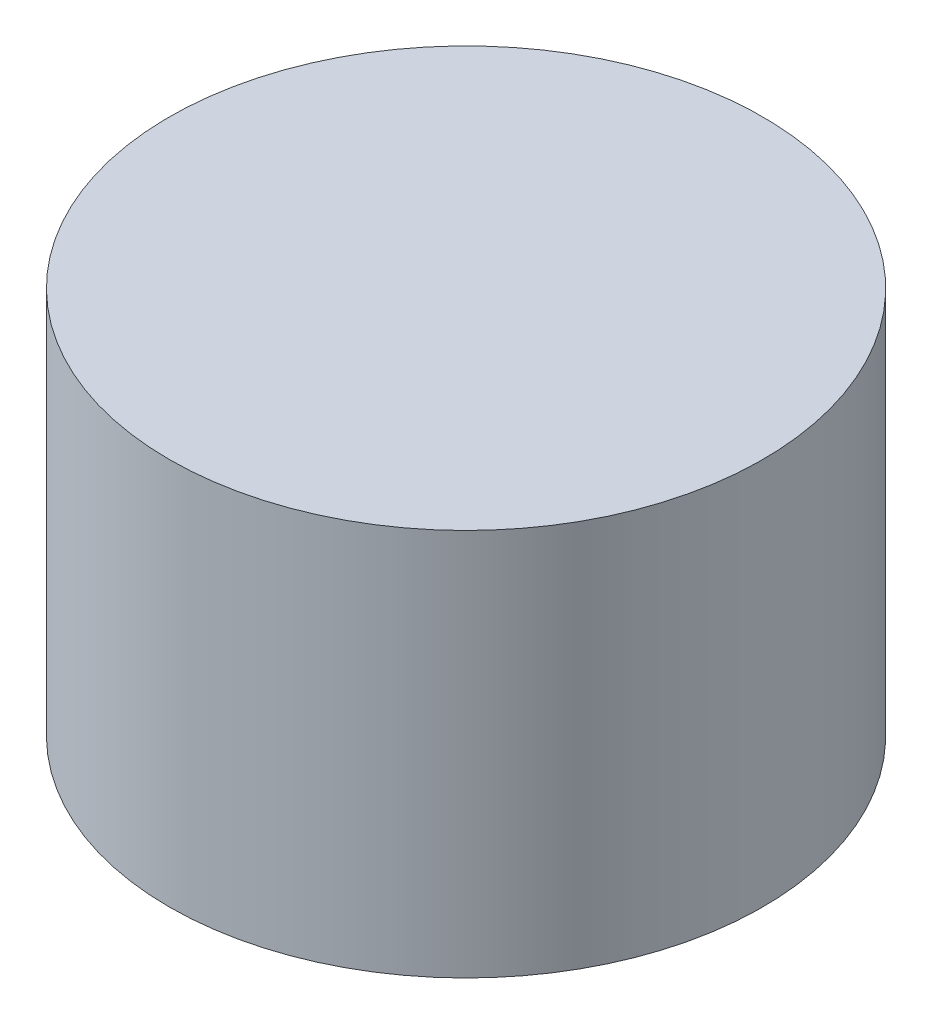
from build123d import *

# Parameters (mm, degrees)
SKETCH_1_R          = 49
EXTRUDE_1_DEPTH     = 64
CUT_EXTRUDE_START   = 16.5
SKETCH_1_3_R        = 35
CUT_EXTRUDE_1_DEPTH = 31


with BuildPart() as part:
    # Sketch 1 → Extrude 1 (new body)
    with BuildSketch(Plane(origin=(0, 0, 0), x_dir=(1, 0, 0), z_dir=(0, 1, 0))):
        with Locations(Location((0, 0, 0), (0, 0, 270))):
            Circle(SKETCH_1_R)
    extrude(amount=EXTRUDE_1_DEPTH)

    # Sketch 1_3 → Cut-Extrude 1 (cut)
    with BuildSketch(Plane(origin=(0, 0, 0), x_dir=(1, 0, 0), z_dir=(0, 1, 0)).offset(CUT_EXTRUDE_START)):
        with Locations(Location((0, 0, 0), (0, 0, 270))):
            Circle(SKETCH_1_3_R)
    extrude(amount=CUT_EXTRUDE_1_DEPTH, mode=Mode.SUBTRACT)


solid = part.part
